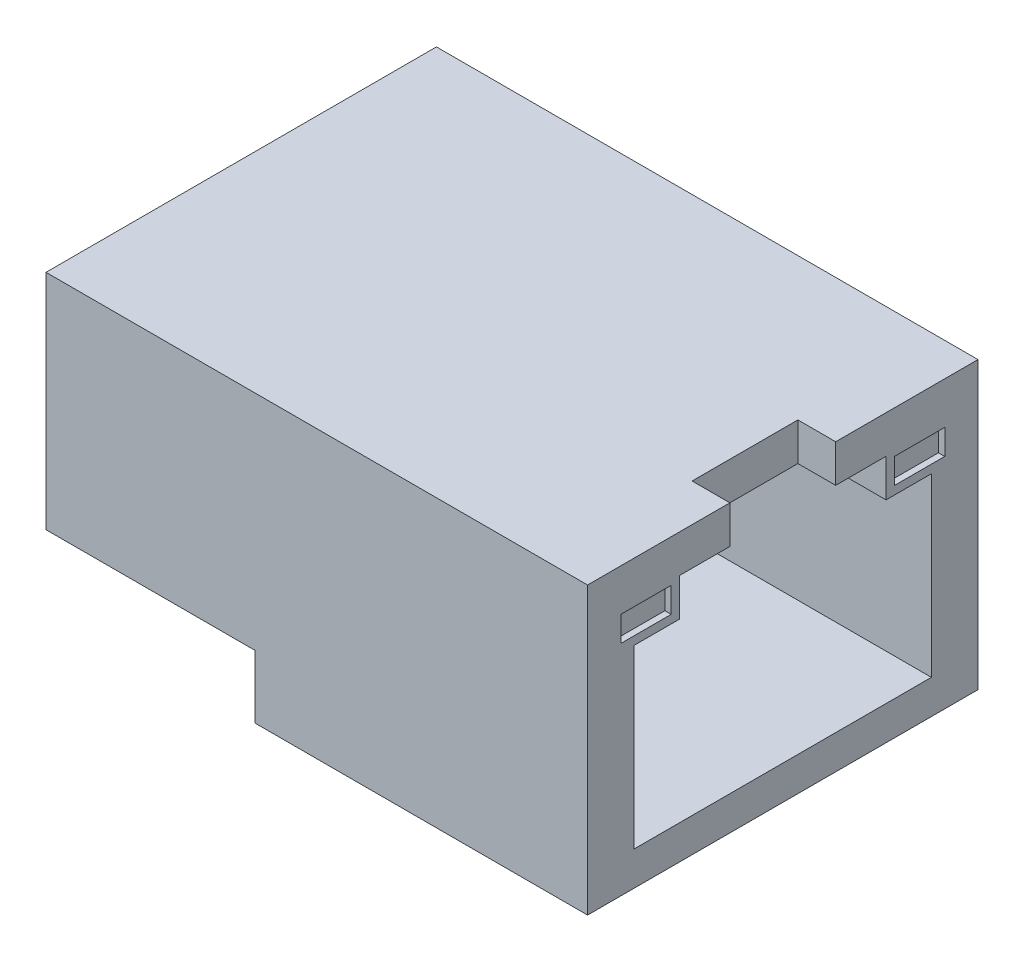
from build123d import *

# Parameters (mm, degrees)
BOSS_EXTRUDE1_DEPTH = 15.5
SKETCH2_R           = 0.55
BOSS_EXTRUDE2_DEPTH = 1.6
CHAMFER1_SIZE       = 0.1
SKETCH3_W           = 4.2
SKETCH3_H           = 1.5
CUT_EXTRUDE1_DEPTH  = 1.5
SKETCH4_W           = 8.2
SKETCH4_H           = 1.5
CUT_EXTRUDE2_DEPTH  = 12
SKETCH5_W           = 11.8
SKETCH5_H           = 7
CUT_EXTRUDE3_DEPTH  = 12
SKETCH6_W           = 2
SKETCH6_H           = 1
CUT_EXTRUDE4_DEPTH  = 0.25


with BuildPart() as part:
    # Sketch1 → Boss-Extrude1 (new body)
    with BuildSketch(Plane.XY):
        Polygon((-10.75, 4.84984995), (10.75, 4.84984995), (10.75, -6.50015005), (-2.45, -6.50015005), (-2.45, -4.00015005), (-10.75, -4.00015005), align=None)
    extrude(amount=BOSS_EXTRUDE1_DEPTH)

    # Sketch2 → Boss-Extrude2 (add)
    with BuildSketch(Plane.XZ.offset(4.00015005)):
        with Locations(Location((-7.45, 11.25, 0), (0, 0, 90))):
            Circle(SKETCH2_R)
        with Locations(Location((-7.45, 4.25, 0), (0, 0, 90))):
            Circle(SKETCH2_R)
    extrude(amount=BOSS_EXTRUDE2_DEPTH)

    # Chamfer1
    chamfer1_edges = [part.edges().sort_by_distance(p)[0] for p in [
        (-7.45, -5.60015005, 10.7),
        (-7.45, -5.60015005, 3.7),
    ]]
    chamfer(chamfer1_edges, length=CHAMFER1_SIZE)

    # Sketch3 → Cut-Extrude1 (cut)
    with BuildSketch(Plane(origin=(10.75, 0, 0), x_dir=(0, 0, -1), z_dir=(1, 0, 0))):
        with Locations((-7.75, 4.09984995)):
            Rectangle(SKETCH3_W, SKETCH3_H)
    extrude(amount=-CUT_EXTRUDE1_DEPTH, mode=Mode.SUBTRACT)

    # Sketch4 → Cut-Extrude2 (cut)
    with BuildSketch(Plane(origin=(10.75, 0, 0), x_dir=(0, 0, -1), z_dir=(1, 0, 0))):
        with Locations((-7.75, 2.59984995)):
            Rectangle(SKETCH4_W, SKETCH4_H)
    extrude(amount=-CUT_EXTRUDE2_DEPTH, mode=Mode.SUBTRACT)

    # Sketch5 → Cut-Extrude3 (cut)
    with BuildSketch(Plane(origin=(10.75, 0, 0), x_dir=(0, 0, -1), z_dir=(1, 0, 0))):
        with Locations((-7.75, -1.65015005)):
            Rectangle(SKETCH5_W, SKETCH5_H)
    extrude(amount=-CUT_EXTRUDE3_DEPTH, mode=Mode.SUBTRACT)

    # Sketch6 → Cut-Extrude4 (cut)
    with BuildSketch(Plane(origin=(10.75, 0, 0), x_dir=(0, 0, -1), z_dir=(1, 0, 0))):
        with Locations((-13.18, 2.67984995)):
            Rectangle(SKETCH6_W, SKETCH6_H)
        with Locations((-2.32, 2.67984995)):
            Rectangle(SKETCH6_W, SKETCH6_H)
    extrude(amount=-CUT_EXTRUDE4_DEPTH, mode=Mode.SUBTRACT)


solid = part.part
